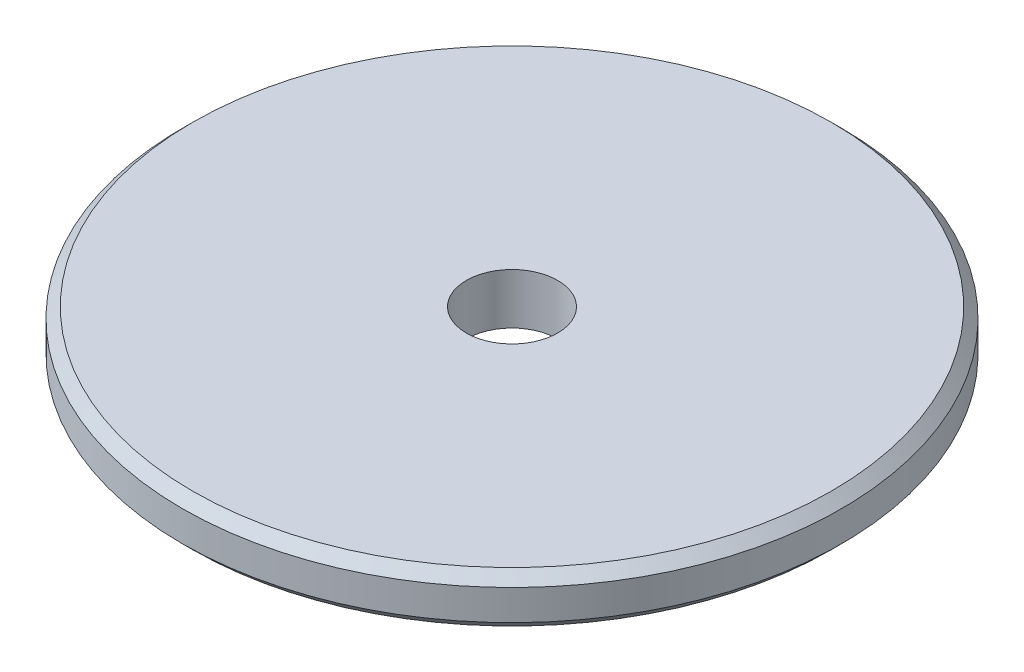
ISO-10303-21;
HEADER;
FILE_DESCRIPTION(('STEP AP214'),'2;1');
FILE_NAME('part.step','',(''),(''),'','','');
FILE_SCHEMA(('AUTOMOTIVE_DESIGN { 1 0 10303 214 1 1 1 1 }'));
ENDSEC;
DATA;
#1=APPLICATION_CONTEXT('core data for automotive mechanical design processes');
#2=APPLICATION_PROTOCOL_DEFINITION('international standard','automotive_design',2000,#1);
#3=PRODUCT_CONTEXT('',#1,'mechanical');
#4=PRODUCT('Part','Part','',(#3));
#5=PRODUCT_RELATED_PRODUCT_CATEGORY('part','',(#4));
#6=PRODUCT_DEFINITION_FORMATION('','',#4);
#7=PRODUCT_DEFINITION_CONTEXT('part definition',#1,'design');
#8=PRODUCT_DEFINITION('design','',#6,#7);
#9=PRODUCT_DEFINITION_SHAPE('','',#8);
#10=(LENGTH_UNIT() NAMED_UNIT(*) SI_UNIT(.MILLI.,.METRE.));
#11=(NAMED_UNIT(*) PLANE_ANGLE_UNIT() SI_UNIT($,.RADIAN.));
#12=(NAMED_UNIT(*) SI_UNIT($,.STERADIAN.) SOLID_ANGLE_UNIT());
#13=UNCERTAINTY_MEASURE_WITH_UNIT(LENGTH_MEASURE(1.E-05),#10,'distance_accuracy_value','');
#14=(GEOMETRIC_REPRESENTATION_CONTEXT(3) GLOBAL_UNCERTAINTY_ASSIGNED_CONTEXT((#13)) GLOBAL_UNIT_ASSIGNED_CONTEXT((#10,
#11,#12)) REPRESENTATION_CONTEXT('',''));
#15=CARTESIAN_POINT('',(0.,0.,0.));
#16=DIRECTION('',(0.,0.,1.));
#17=DIRECTION('',(1.,0.,0.));
#18=AXIS2_PLACEMENT_3D('',#15,#16,#17);
#19=CARTESIAN_POINT('',(0.,5.,0.));
#20=DIRECTION('',(0.,1.,0.));
#21=DIRECTION('',(0.,0.,1.));
#22=AXIS2_PLACEMENT_3D('',#19,#20,#21);
#23=PLANE('',#22);
#24=CARTESIAN_POINT('',(0.,5.,0.));
#25=DIRECTION('',(0.,1.,0.));
#26=DIRECTION('',(0.,0.,1.));
#27=AXIS2_PLACEMENT_3D('',#24,#25,#26);
#28=CIRCLE('',#27,31.5);
#29=CARTESIAN_POINT('',(0.,5.,31.5));
#30=VERTEX_POINT('',#29);
#31=EDGE_CURVE('E10',#30,#30,#28,.T.);
#32=ORIENTED_EDGE('',*,*,#31,.T.);
#33=EDGE_LOOP('',(#32));
#34=FACE_BOUND('',#33,.T.);
#35=CARTESIAN_POINT('',(0.,5.,0.));
#36=DIRECTION('',(0.,1.,0.));
#37=DIRECTION('',(0.,0.,1.));
#38=AXIS2_PLACEMENT_3D('',#35,#36,#37);
#39=CIRCLE('',#38,4.5);
#40=CARTESIAN_POINT('',(0.,5.,4.5));
#41=VERTEX_POINT('',#40);
#42=EDGE_CURVE('E49',#41,#41,#39,.T.);
#43=ORIENTED_EDGE('',*,*,#42,.F.);
#44=EDGE_LOOP('',(#43));
#45=FACE_BOUND('',#44,.T.);
#46=ADVANCED_FACE('F29',(#34,#45),#23,.T.);
#47=CARTESIAN_POINT('',(0.,0.,0.));
#48=DIRECTION('',(0.,1.,0.));
#49=DIRECTION('',(0.,0.,1.));
#50=AXIS2_PLACEMENT_3D('',#47,#48,#49);
#51=PLANE('',#50);
#52=CARTESIAN_POINT('',(0.,0.,0.));
#53=DIRECTION('',(0.,1.,0.));
#54=DIRECTION('',(0.,0.,1.));
#55=AXIS2_PLACEMENT_3D('',#52,#53,#54);
#56=CIRCLE('',#55,31.5);
#57=CARTESIAN_POINT('',(0.,0.,31.5));
#58=VERTEX_POINT('',#57);
#59=EDGE_CURVE('E36',#58,#58,#56,.F.);
#60=ORIENTED_EDGE('',*,*,#59,.T.);
#61=EDGE_LOOP('',(#60));
#62=FACE_BOUND('',#61,.T.);
#63=CARTESIAN_POINT('',(0.,0.,0.));
#64=DIRECTION('',(0.,1.,0.));
#65=DIRECTION('',(0.,0.,1.));
#66=AXIS2_PLACEMENT_3D('',#63,#64,#65);
#67=CIRCLE('',#66,4.5);
#68=CARTESIAN_POINT('',(0.,0.,4.5));
#69=VERTEX_POINT('',#68);
#70=EDGE_CURVE('E50',#69,#69,#67,.T.);
#71=ORIENTED_EDGE('',*,*,#70,.T.);
#72=EDGE_LOOP('',(#71));
#73=FACE_BOUND('',#72,.T.);
#74=ADVANCED_FACE('F60',(#62,#73),#51,.F.);
#75=CARTESIAN_POINT('',(0.,5.,0.));
#76=DIRECTION('',(0.,-1.,0.));
#77=DIRECTION('',(0.,0.,-1.));
#78=AXIS2_PLACEMENT_3D('',#75,#76,#77);
#79=CYLINDRICAL_SURFACE('',#78,32.5);
#80=CARTESIAN_POINT('',(0.,0.999999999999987,0.));
#81=DIRECTION('',(0.,1.,0.));
#82=DIRECTION('',(0.,0.,1.));
#83=AXIS2_PLACEMENT_3D('',#80,#81,#82);
#84=CIRCLE('',#83,32.5);
#85=CARTESIAN_POINT('',(0.,0.999999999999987,32.5));
#86=VERTEX_POINT('',#85);
#87=EDGE_CURVE('E40',#86,#86,#84,.T.);
#88=ORIENTED_EDGE('',*,*,#87,.T.);
#89=EDGE_LOOP('',(#88));
#90=FACE_BOUND('',#89,.T.);
#91=CARTESIAN_POINT('',(0.,4.00000000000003,0.));
#92=DIRECTION('',(0.,1.,0.));
#93=DIRECTION('',(0.,0.,1.));
#94=AXIS2_PLACEMENT_3D('',#91,#92,#93);
#95=CIRCLE('',#94,32.5);
#96=CARTESIAN_POINT('',(0.,4.00000000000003,32.5));
#97=VERTEX_POINT('',#96);
#98=EDGE_CURVE('E44',#97,#97,#95,.F.);
#99=ORIENTED_EDGE('',*,*,#98,.T.);
#100=EDGE_LOOP('',(#99));
#101=FACE_BOUND('',#100,.T.);
#102=ADVANCED_FACE('F65',(#90,#101),#79,.T.);
#103=CARTESIAN_POINT('',(0.,5.,0.));
#104=DIRECTION('',(0.,-1.,0.));
#105=DIRECTION('',(0.,0.,-1.));
#106=AXIS2_PLACEMENT_3D('',#103,#104,#105);
#107=CYLINDRICAL_SURFACE('',#106,4.5);
#108=ORIENTED_EDGE('',*,*,#42,.T.);
#109=EDGE_LOOP('',(#108));
#110=FACE_BOUND('',#109,.T.);
#111=ORIENTED_EDGE('',*,*,#70,.F.);
#112=EDGE_LOOP('',(#111));
#113=FACE_BOUND('',#112,.T.);
#114=ADVANCED_FACE('F56',(#110,#113),#107,.F.);
#115=CARTESIAN_POINT('',(0.,0.999999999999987,0.));
#116=DIRECTION('',(0.,1.,0.));
#117=DIRECTION('',(0.,0.,1.));
#118=AXIS2_PLACEMENT_3D('',#115,#116,#117);
#119=CONICAL_SURFACE('',#118,32.5,0.785398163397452);
#120=ORIENTED_EDGE('',*,*,#59,.F.);
#121=EDGE_LOOP('',(#120));
#122=FACE_BOUND('',#121,.T.);
#123=ORIENTED_EDGE('',*,*,#87,.F.);
#124=EDGE_LOOP('',(#123));
#125=FACE_BOUND('',#124,.T.);
#126=ADVANCED_FACE('F71',(#122,#125),#119,.T.);
#127=CARTESIAN_POINT('',(0.,5.,0.));
#128=DIRECTION('',(0.,-1.,0.));
#129=DIRECTION('',(0.,0.,-1.));
#130=AXIS2_PLACEMENT_3D('',#127,#128,#129);
#131=CONICAL_SURFACE('',#130,31.5,0.785398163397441);
#132=ORIENTED_EDGE('',*,*,#98,.F.);
#133=EDGE_LOOP('',(#132));
#134=FACE_BOUND('',#133,.T.);
#135=ORIENTED_EDGE('',*,*,#31,.F.);
#136=EDGE_LOOP('',(#135));
#137=FACE_BOUND('',#136,.T.);
#138=ADVANCED_FACE('F31',(#134,#137),#131,.T.);
#139=CLOSED_SHELL('',(#46,#74,#102,#114,#126,#138));
#140=MANIFOLD_SOLID_BREP('B2',#139);
#141=ADVANCED_BREP_SHAPE_REPRESENTATION('',(#18,#140),#14);
#142=SHAPE_DEFINITION_REPRESENTATION(#9,#141);
ENDSEC;
END-ISO-10303-21;
